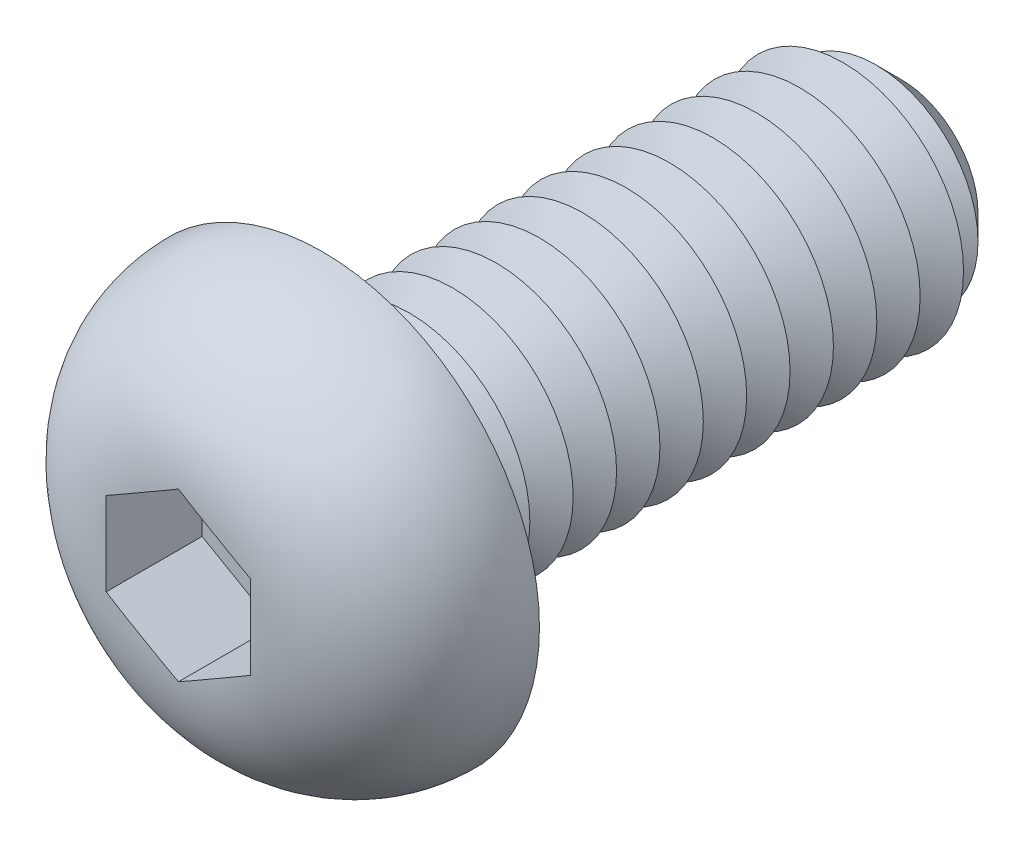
from build123d import *

# Parameters (mm, degrees)
CUT_EXTRUDE1_DEPTH  = 1
SKETCH4_R           = 1.25
BOSS_EXTRUDE1_DEPTH = 6
CHAMFER1_SIZE       = 0.45
LPATTERN1_COUNT     = 12
LPATTERN1_PITCH     = 0.45
FILLET2_R           = 0.225
SKETCH6_R           = 0.45
CUT_EXTRUDE2_DEPTH  = 6.5


with BuildPart() as part:
    # Sketch2 → Revolve1 (revolve)
    with BuildSketch(Plane(origin=(0, 0, 0), x_dir=(0, 0, -1), z_dir=(1, 0, 0)), mode=Mode.PRIVATE) as revolve1_sk:
        with BuildLine():
            Line((0, 0), (-1.5, 0))
            Line((-1.5, 0), (-1.5, 0.75))
            ThreePointArc((-1.5, 0.75), (-1.060660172, 1.810660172), (0, 2.25))
            Line((0, 2.25), (0, 0))
        make_face()
    revolve(revolve1_sk.sketch.rotate(Axis((0, 0, 47.934239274), (0, 0, -1)), 90), axis=Axis((0, 0, 47.934239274), (0, 0, -1)))

    # Sketch3 → Cut-Extrude1 (cut)
    with BuildSketch(Plane.XY.offset(1.5)):
        Polygon((0, 0.866025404), (-0.75, 0.433012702), (-0.75, -0.433012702), (0, -0.866025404), (0.75, -0.433012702), (0.75, 0.433012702), align=None)
    extrude(amount=-CUT_EXTRUDE1_DEPTH, mode=Mode.SUBTRACT)

    # Sketch4 → Boss-Extrude1 (add)
    with BuildSketch(Plane(origin=(0, 0, 0), x_dir=(-1, 0, 0), z_dir=(0, 0, -1))):
        with Locations(Location((0, 0, 0), (0, 0, 180))):
            Circle(SKETCH4_R)
    extrude(amount=BOSS_EXTRUDE1_DEPTH)

    # Chamfer1
    chamfer1_edges = [part.edges().sort_by_distance(p)[0] for p in [
        (-1.25, 0, -6),
    ]]
    chamfer(chamfer1_edges, length=CHAMFER1_SIZE)

    # Sketch5 → Cut-Revolve1 (revolve, cut)
    with BuildSketch(Plane(origin=(0, 0, 0), x_dir=(0, 0, -1), z_dir=(1, 0, 0)), mode=Mode.PRIVATE) as cut_revolve1_sk:
        Polygon((0.45, 1.25), (0.9, 1.25), (0.675, 0.860288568), align=None)
    cut_revolve1 = revolve(cut_revolve1_sk.sketch.rotate(Axis((0, 0, 47.934239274), (0, 0, -1)), 90), axis=Axis((0, 0, 47.934239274), (0, 0, -1)), mode=Mode.SUBTRACT)

    # LPattern1: Cut-Revolve1 ×12
    with Locations(*[(0, 0, -i * LPATTERN1_PITCH) for i in range(1, LPATTERN1_COUNT)]):
        add(cut_revolve1, mode=Mode.SUBTRACT)

    # Fillet2
    fillet2_edges = [part.edges().sort_by_distance(p)[0] for p in [
        (-1.25, 0, 0),
    ]]
    fillet(fillet2_edges, radius=FILLET2_R)

    # Sketch6 → Cut-Extrude2 (cut)
    with BuildSketch(Plane.XY.offset(0.5)):
        Circle(SKETCH6_R)
    extrude(amount=-CUT_EXTRUDE2_DEPTH, mode=Mode.SUBTRACT)


solid = part.part
